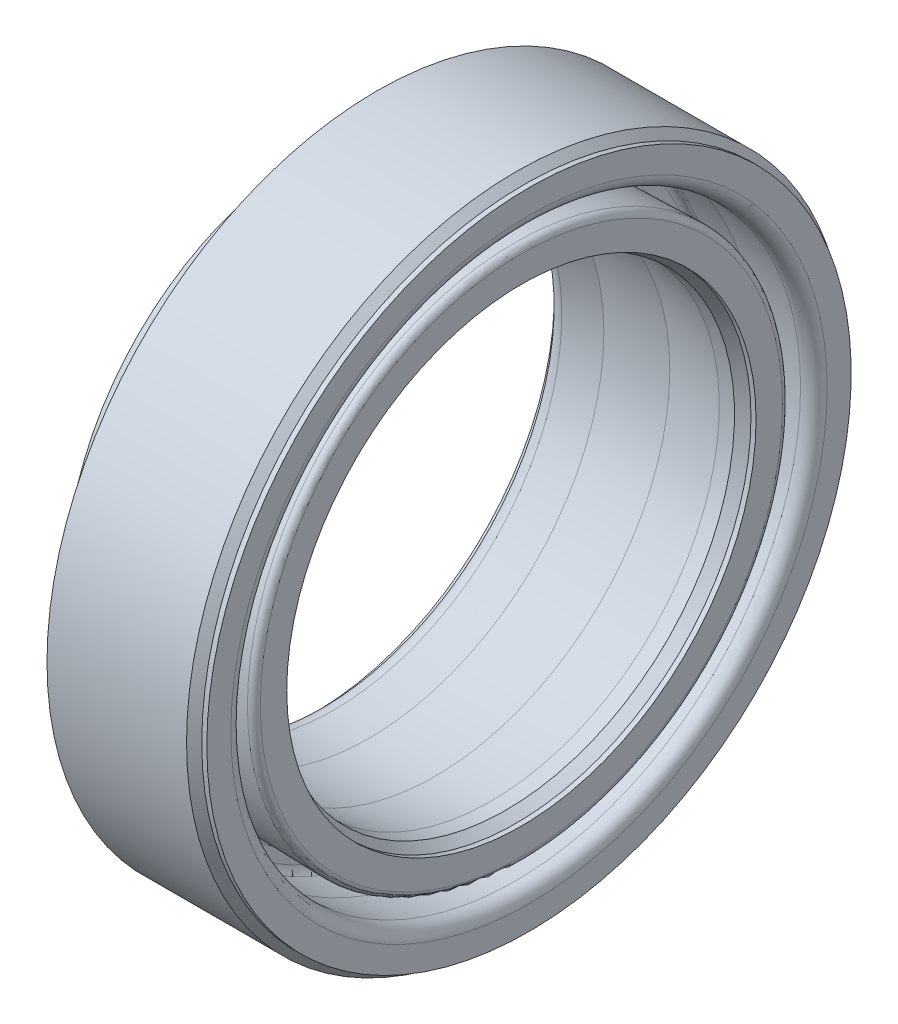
from build123d import *


with BuildPart() as part:
    # Esquisse1 → Base-R_volution (revolve)
    with BuildSketch(Plane.XY, mode=Mode.PRIVATE) as base_r_volution_sk:
        with BuildLine():
            Line((575.435578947, 452.492949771), (575.435578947, 450.542949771))
            Line((575.435578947, 450.542949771), (574.935578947, 450.292949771))
            Line((574.935578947, 450.292949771), (574.935578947, 449.983480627))
            add(Edge.make_bspline(
                [(574.751868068, 449.742429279), (574.864667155, 449.773449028), (574.935578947, 449.866494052), (574.935578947, 449.983480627)],
                knots=[0, 0, 0, 0, 1, 1, 1, 1], degree=3, weights=[1, 0.86356525, 0.86356525, 1]))
            Line((574.751868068, 449.742429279), (572.935578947, 449.242949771))
            Line((572.935578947, 449.242949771), (572.935578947, 448.992949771))
            Line((572.935578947, 448.992949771), (573.135578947, 448.992949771))
            add(Edge.make_bspline(
                [(573.720111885, 448.500147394), (573.390929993, 448.443681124), (573.135578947, 448.658960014), (573.135578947, 448.992949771)],
                knots=[0, 0, 0, 0, 1, 1, 1, 1], degree=3, weights=[1, 0.763044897, 0.763044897, 1]))
            Line((573.720111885, 448.500147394), (575.135578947, 448.742949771))
            Line((575.135578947, 448.742949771), (577.735578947, 448.742949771))
            Line((577.735578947, 448.742949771), (579.935578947, 448.492949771))
            Line((579.935578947, 448.492949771), (580.535578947, 448.492949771))
            Line((580.535578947, 448.492949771), (580.935578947, 448.742949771))
            Line((580.935578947, 448.742949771), (581.135578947, 448.742949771))
            Line((581.135578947, 448.742949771), (581.135578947, 449.786457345))
            add(Edge.make_bspline(
                [(581.135578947, 449.786457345), (581.135578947, 449.93589821), (581.028562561, 450.040205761), (580.879170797, 450.036375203)],
                knots=[0, 0, 0, 0, 1, 1, 1, 1], degree=3, weights=[1, 0.798656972, 0.798656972, 1]))
            Line((580.879170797, 450.036375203), (577.491987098, 449.949524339))
            add(Edge.make_bspline(
                [(577.235578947, 450.199442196), (577.235578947, 450.050001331), (577.342595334, 449.945693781), (577.491987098, 449.949524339)],
                knots=[0, 0, 0, 0, 1, 1, 1, 1], degree=3, weights=[1, 0.798656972, 0.798656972, 1]))
            Line((577.235578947, 450.199442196), (577.235578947, 450.692949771))
            add(Edge.make_bspline(
                [(577.485578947, 450.942949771), (577.339132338, 450.942949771), (577.235578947, 450.83939638), (577.235578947, 450.692949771)],
                knots=[0, 0, 0, 0, 1, 1, 1, 1], degree=3, weights=[1, 0.804737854, 0.804737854, 1]))
            Line((577.485578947, 450.942949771), (578.935578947, 450.942949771))
            Line((578.935578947, 450.942949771), (580.885827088, 450.747924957))
            add(Edge.make_bspline(
                [(580.885827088, 450.747924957), (581.200843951, 450.71642327), (581.435578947, 450.928855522), (581.435578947, 451.245443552)],
                knots=[0, 0, 0, 0, 1, 1, 1, 1], degree=3, weights=[1, 0.780670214, 0.780670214, 1]))
            Line((581.435578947, 451.245443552), (581.435578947, 452.192949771))
            Line((581.435578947, 452.192949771), (581.235578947, 452.192949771))
            Line((581.235578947, 452.192949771), (580.935578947, 452.492949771))
            Line((580.935578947, 452.492949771), (575.435578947, 452.492949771))
        make_face()
    revolve(base_r_volution_sk.sketch.rotate(Axis((563.64609093, 439.492949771, 0), (1, 0, 0)), 90), axis=Axis((563.64609093, 439.492949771, 0), (1, 0, 0)))


solid = part.part
